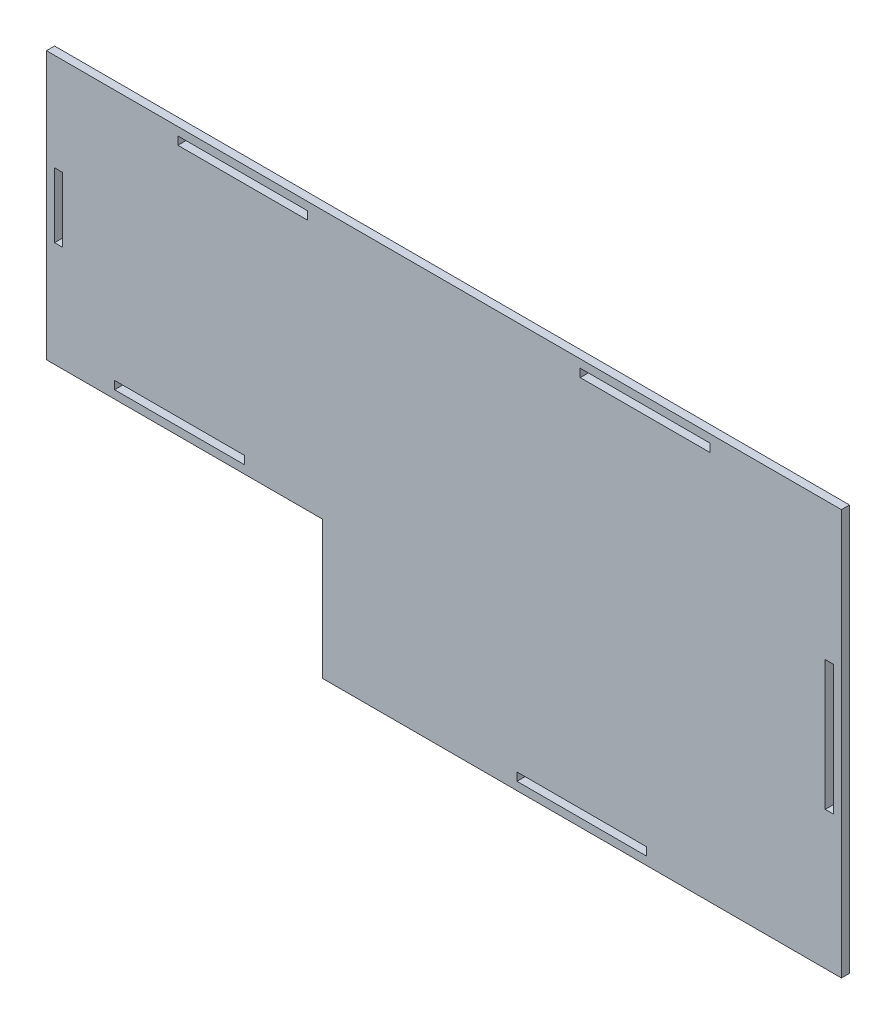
ISO-10303-21;
HEADER;
FILE_DESCRIPTION(('STEP AP214'),'2;1');
FILE_NAME('part.step','',(''),(''),'','','');
FILE_SCHEMA(('AUTOMOTIVE_DESIGN { 1 0 10303 214 1 1 1 1 }'));
ENDSEC;
DATA;
#1=APPLICATION_CONTEXT('core data for automotive mechanical design processes');
#2=APPLICATION_PROTOCOL_DEFINITION('international standard','automotive_design',2000,#1);
#3=PRODUCT_CONTEXT('',#1,'mechanical');
#4=PRODUCT('Part','Part','',(#3));
#5=PRODUCT_RELATED_PRODUCT_CATEGORY('part','',(#4));
#6=PRODUCT_DEFINITION_FORMATION('','',#4);
#7=PRODUCT_DEFINITION_CONTEXT('part definition',#1,'design');
#8=PRODUCT_DEFINITION('design','',#6,#7);
#9=PRODUCT_DEFINITION_SHAPE('','',#8);
#10=(LENGTH_UNIT() NAMED_UNIT(*) SI_UNIT(.MILLI.,.METRE.));
#11=(NAMED_UNIT(*) PLANE_ANGLE_UNIT() SI_UNIT($,.RADIAN.));
#12=(NAMED_UNIT(*) SI_UNIT($,.STERADIAN.) SOLID_ANGLE_UNIT());
#13=UNCERTAINTY_MEASURE_WITH_UNIT(LENGTH_MEASURE(1.E-05),#10,'distance_accuracy_value','');
#14=(GEOMETRIC_REPRESENTATION_CONTEXT(3) GLOBAL_UNCERTAINTY_ASSIGNED_CONTEXT((#13)) GLOBAL_UNIT_ASSIGNED_CONTEXT((#10,
#11,#12)) REPRESENTATION_CONTEXT('',''));
#15=CARTESIAN_POINT('',(0.,0.,0.));
#16=DIRECTION('',(0.,0.,1.));
#17=DIRECTION('',(1.,0.,0.));
#18=AXIS2_PLACEMENT_3D('',#15,#16,#17);
#19=CARTESIAN_POINT('',(-195.284836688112,2.75233401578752,3.175));
#20=DIRECTION('',(0.,0.,-1.));
#21=DIRECTION('',(-1.,0.,0.));
#22=AXIS2_PLACEMENT_3D('',#19,#20,#21);
#23=PLANE('',#22);
#24=DIRECTION('',(0.,-1.,0.));
#25=VECTOR('',#24,1.);
#26=CARTESIAN_POINT('',(-143.849836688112,104.352334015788,3.175));
#27=LINE('',#26,#25);
#28=CARTESIAN_POINT('',(-143.849836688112,104.352334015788,3.175));
#29=VERTEX_POINT('',#28);
#30=CARTESIAN_POINT('',(-143.849836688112,101.177334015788,3.175));
#31=VERTEX_POINT('',#30);
#32=EDGE_CURVE('E265',#29,#31,#27,.T.);
#33=ORIENTED_EDGE('',*,*,#32,.F.);
#34=DIRECTION('',(-1.,0.,0.));
#35=VECTOR('',#34,1.);
#36=CARTESIAN_POINT('',(-143.849836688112,104.352334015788,3.175));
#37=LINE('',#36,#35);
#38=CARTESIAN_POINT('',(-93.049836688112,104.352334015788,3.175));
#39=VERTEX_POINT('',#38);
#40=EDGE_CURVE('E273',#39,#29,#37,.T.);
#41=ORIENTED_EDGE('',*,*,#40,.F.);
#42=DIRECTION('',(0.,1.,0.));
#43=VECTOR('',#42,1.);
#44=CARTESIAN_POINT('',(-93.049836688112,104.352334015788,3.175));
#45=LINE('',#44,#43);
#46=CARTESIAN_POINT('',(-93.049836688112,101.177334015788,3.175));
#47=VERTEX_POINT('',#46);
#48=EDGE_CURVE('E270',#47,#39,#45,.T.);
#49=ORIENTED_EDGE('',*,*,#48,.F.);
#50=DIRECTION('',(1.,0.,0.));
#51=VECTOR('',#50,1.);
#52=CARTESIAN_POINT('',(-143.849836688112,101.177334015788,3.175));
#53=LINE('',#52,#51);
#54=EDGE_CURVE('E267',#31,#47,#53,.T.);
#55=ORIENTED_EDGE('',*,*,#54,.F.);
#56=EDGE_LOOP('',(#33,#41,#49,#55));
#57=FACE_BOUND('',#56,.T.);
#58=DIRECTION('',(0.,-1.,0.));
#59=VECTOR('',#58,1.);
#60=CARTESIAN_POINT('',(-11.1348366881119,-44.8726659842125,3.175));
#61=LINE('',#60,#59);
#62=CARTESIAN_POINT('',(-11.1348366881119,-44.8726659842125,3.175));
#63=VERTEX_POINT('',#62);
#64=CARTESIAN_POINT('',(-11.1348366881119,-48.0476659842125,3.175));
#65=VERTEX_POINT('',#64);
#66=EDGE_CURVE('E327',#63,#65,#61,.T.);
#67=ORIENTED_EDGE('',*,*,#66,.F.);
#68=DIRECTION('',(-1.,0.,0.));
#69=VECTOR('',#68,1.);
#70=CARTESIAN_POINT('',(-11.1348366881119,-44.8726659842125,3.175));
#71=LINE('',#70,#69);
#72=CARTESIAN_POINT('',(39.6651633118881,-44.8726659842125,3.175));
#73=VERTEX_POINT('',#72);
#74=EDGE_CURVE('E335',#73,#63,#71,.T.);
#75=ORIENTED_EDGE('',*,*,#74,.F.);
#76=DIRECTION('',(0.,1.,0.));
#77=VECTOR('',#76,1.);
#78=CARTESIAN_POINT('',(39.6651633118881,-44.8726659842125,3.175));
#79=LINE('',#78,#77);
#80=CARTESIAN_POINT('',(39.6651633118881,-48.0476659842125,3.175));
#81=VERTEX_POINT('',#80);
#82=EDGE_CURVE('E332',#81,#73,#79,.T.);
#83=ORIENTED_EDGE('',*,*,#82,.F.);
#84=DIRECTION('',(1.,0.,0.));
#85=VECTOR('',#84,1.);
#86=CARTESIAN_POINT('',(-11.1348366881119,-48.0476659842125,3.175));
#87=LINE('',#86,#85);
#88=EDGE_CURVE('E329',#65,#81,#87,.T.);
#89=ORIENTED_EDGE('',*,*,#88,.F.);
#90=EDGE_LOOP('',(#67,#75,#83,#89));
#91=FACE_BOUND('',#90,.T.);
#92=DIRECTION('',(0.,-1.,0.));
#93=VECTOR('',#92,1.);
#94=CARTESIAN_POINT('',(-168.614836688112,5.92733401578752,3.175));
#95=LINE('',#94,#93);
#96=CARTESIAN_POINT('',(-168.614836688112,9.10233401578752,3.175));
#97=VERTEX_POINT('',#96);
#98=CARTESIAN_POINT('',(-168.614836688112,5.92733401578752,3.175));
#99=VERTEX_POINT('',#98);
#100=EDGE_CURVE('E389',#97,#99,#95,.T.);
#101=ORIENTED_EDGE('',*,*,#100,.F.);
#102=DIRECTION('',(-1.,0.,0.));
#103=VECTOR('',#102,1.);
#104=CARTESIAN_POINT('',(-168.614836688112,9.10233401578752,3.175));
#105=LINE('',#104,#103);
#106=CARTESIAN_POINT('',(-117.814836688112,9.10233401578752,3.175));
#107=VERTEX_POINT('',#106);
#108=EDGE_CURVE('E397',#107,#97,#105,.T.);
#109=ORIENTED_EDGE('',*,*,#108,.F.);
#110=DIRECTION('',(0.,1.,0.));
#111=VECTOR('',#110,1.);
#112=CARTESIAN_POINT('',(-117.814836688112,5.92733401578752,3.175));
#113=LINE('',#112,#111);
#114=CARTESIAN_POINT('',(-117.814836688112,5.92733401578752,3.175));
#115=VERTEX_POINT('',#114);
#116=EDGE_CURVE('E394',#115,#107,#113,.T.);
#117=ORIENTED_EDGE('',*,*,#116,.F.);
#118=DIRECTION('',(1.,0.,0.));
#119=VECTOR('',#118,1.);
#120=CARTESIAN_POINT('',(-168.614836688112,5.92733401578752,3.175));
#121=LINE('',#120,#119);
#122=EDGE_CURVE('E391',#99,#115,#121,.T.);
#123=ORIENTED_EDGE('',*,*,#122,.F.);
#124=EDGE_LOOP('',(#101,#109,#117,#123));
#125=FACE_BOUND('',#124,.T.);
#126=DIRECTION('',(1.,0.,0.));
#127=VECTOR('',#126,1.);
#128=CARTESIAN_POINT('',(-87.3348366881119,2.75233401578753,3.175));
#129=LINE('',#128,#127);
#130=CARTESIAN_POINT('',(-195.284836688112,2.75233401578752,3.175));
#131=VERTEX_POINT('',#130);
#132=CARTESIAN_POINT('',(-87.3348366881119,2.75233401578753,3.175));
#133=VERTEX_POINT('',#132);
#134=EDGE_CURVE('E420',#131,#133,#129,.T.);
#135=ORIENTED_EDGE('',*,*,#134,.T.);
#136=DIRECTION('',(0.,-1.,0.));
#137=VECTOR('',#136,1.);
#138=CARTESIAN_POINT('',(-87.3348366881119,2.75233401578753,3.175));
#139=LINE('',#138,#137);
#140=CARTESIAN_POINT('',(-87.3348366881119,-51.2226659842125,3.175));
#141=VERTEX_POINT('',#140);
#142=EDGE_CURVE('E423',#133,#141,#139,.T.);
#143=ORIENTED_EDGE('',*,*,#142,.T.);
#144=DIRECTION('',(1.,0.,0.));
#145=VECTOR('',#144,1.);
#146=CARTESIAN_POINT('',(-87.3348366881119,-51.2226659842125,3.175));
#147=LINE('',#146,#145);
#148=CARTESIAN_POINT('',(115.865163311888,-51.2226659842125,3.175));
#149=VERTEX_POINT('',#148);
#150=EDGE_CURVE('E426',#141,#149,#147,.T.);
#151=ORIENTED_EDGE('',*,*,#150,.T.);
#152=DIRECTION('',(0.,1.,0.));
#153=VECTOR('',#152,1.);
#154=CARTESIAN_POINT('',(115.865163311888,107.527334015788,3.175));
#155=LINE('',#154,#153);
#156=CARTESIAN_POINT('',(115.865163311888,107.527334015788,3.175));
#157=VERTEX_POINT('',#156);
#158=EDGE_CURVE('E428',#149,#157,#155,.T.);
#159=ORIENTED_EDGE('',*,*,#158,.T.);
#160=DIRECTION('',(-1.,0.,0.));
#161=VECTOR('',#160,1.);
#162=CARTESIAN_POINT('',(-195.284836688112,107.527334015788,3.175));
#163=LINE('',#162,#161);
#164=CARTESIAN_POINT('',(-195.284836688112,107.527334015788,3.175));
#165=VERTEX_POINT('',#164);
#166=EDGE_CURVE('E430',#157,#165,#163,.T.);
#167=ORIENTED_EDGE('',*,*,#166,.T.);
#168=DIRECTION('',(0.,-1.,0.));
#169=VECTOR('',#168,1.);
#170=CARTESIAN_POINT('',(-195.284836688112,2.75233401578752,3.175));
#171=LINE('',#170,#169);
#172=EDGE_CURVE('E432',#165,#131,#171,.T.);
#173=ORIENTED_EDGE('',*,*,#172,.T.);
#174=EDGE_LOOP('',(#135,#143,#151,#159,#167,#173));
#175=FACE_BOUND('',#174,.T.);
#176=DIRECTION('',(0.,-1.,0.));
#177=VECTOR('',#176,1.);
#178=CARTESIAN_POINT('',(-192.109836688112,69.4273340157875,3.175));
#179=LINE('',#178,#177);
#180=CARTESIAN_POINT('',(-192.109836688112,69.4273340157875,3.175));
#181=VERTEX_POINT('',#180);
#182=CARTESIAN_POINT('',(-192.109836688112,44.0273340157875,3.175));
#183=VERTEX_POINT('',#182);
#184=EDGE_CURVE('E358',#181,#183,#179,.T.);
#185=ORIENTED_EDGE('',*,*,#184,.F.);
#186=DIRECTION('',(-1.,0.,0.));
#187=VECTOR('',#186,1.);
#188=CARTESIAN_POINT('',(-192.109836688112,69.4273340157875,3.175));
#189=LINE('',#188,#187);
#190=CARTESIAN_POINT('',(-188.934836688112,69.4273340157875,3.175));
#191=VERTEX_POINT('',#190);
#192=EDGE_CURVE('E366',#191,#181,#189,.T.);
#193=ORIENTED_EDGE('',*,*,#192,.F.);
#194=DIRECTION('',(0.,1.,0.));
#195=VECTOR('',#194,1.);
#196=CARTESIAN_POINT('',(-188.934836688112,69.4273340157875,3.175));
#197=LINE('',#196,#195);
#198=CARTESIAN_POINT('',(-188.934836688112,44.0273340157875,3.175));
#199=VERTEX_POINT('',#198);
#200=EDGE_CURVE('E363',#199,#191,#197,.T.);
#201=ORIENTED_EDGE('',*,*,#200,.F.);
#202=DIRECTION('',(1.,0.,0.));
#203=VECTOR('',#202,1.);
#204=CARTESIAN_POINT('',(-192.109836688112,44.0273340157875,3.175));
#205=LINE('',#204,#203);
#206=EDGE_CURVE('E360',#183,#199,#205,.T.);
#207=ORIENTED_EDGE('',*,*,#206,.F.);
#208=EDGE_LOOP('',(#185,#193,#201,#207));
#209=FACE_BOUND('',#208,.T.);
#210=DIRECTION('',(0.,1.,0.));
#211=VECTOR('',#210,1.);
#212=CARTESIAN_POINT('',(112.690163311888,53.5523340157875,3.175));
#213=LINE('',#212,#211);
#214=CARTESIAN_POINT('',(112.690163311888,2.75233401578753,3.175));
#215=VERTEX_POINT('',#214);
#216=CARTESIAN_POINT('',(112.690163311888,53.5523340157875,3.175));
#217=VERTEX_POINT('',#216);
#218=EDGE_CURVE('E296',#215,#217,#213,.T.);
#219=ORIENTED_EDGE('',*,*,#218,.F.);
#220=DIRECTION('',(1.,0.,0.));
#221=VECTOR('',#220,1.);
#222=CARTESIAN_POINT('',(112.690163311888,2.75233401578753,3.175));
#223=LINE('',#222,#221);
#224=CARTESIAN_POINT('',(109.515163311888,2.75233401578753,3.175));
#225=VERTEX_POINT('',#224);
#226=EDGE_CURVE('E304',#225,#215,#223,.T.);
#227=ORIENTED_EDGE('',*,*,#226,.F.);
#228=DIRECTION('',(0.,-1.,0.));
#229=VECTOR('',#228,1.);
#230=CARTESIAN_POINT('',(109.515163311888,53.5523340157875,3.175));
#231=LINE('',#230,#229);
#232=CARTESIAN_POINT('',(109.515163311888,53.5523340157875,3.175));
#233=VERTEX_POINT('',#232);
#234=EDGE_CURVE('E301',#233,#225,#231,.T.);
#235=ORIENTED_EDGE('',*,*,#234,.F.);
#236=DIRECTION('',(-1.,0.,0.));
#237=VECTOR('',#236,1.);
#238=CARTESIAN_POINT('',(112.690163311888,53.5523340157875,3.175));
#239=LINE('',#238,#237);
#240=EDGE_CURVE('E298',#217,#233,#239,.T.);
#241=ORIENTED_EDGE('',*,*,#240,.F.);
#242=EDGE_LOOP('',(#219,#227,#235,#241));
#243=FACE_BOUND('',#242,.T.);
#244=DIRECTION('',(0.,-1.,0.));
#245=VECTOR('',#244,1.);
#246=CARTESIAN_POINT('',(13.6301633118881,104.352334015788,3.175));
#247=LINE('',#246,#245);
#248=CARTESIAN_POINT('',(13.6301633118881,104.352334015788,3.175));
#249=VERTEX_POINT('',#248);
#250=CARTESIAN_POINT('',(13.6301633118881,101.177334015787,3.175));
#251=VERTEX_POINT('',#250);
#252=EDGE_CURVE('E229',#249,#251,#247,.T.);
#253=ORIENTED_EDGE('',*,*,#252,.F.);
#254=DIRECTION('',(-1.,0.,0.));
#255=VECTOR('',#254,1.);
#256=CARTESIAN_POINT('',(13.6301633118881,104.352334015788,3.175));
#257=LINE('',#256,#255);
#258=CARTESIAN_POINT('',(64.4301633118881,104.352334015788,3.175));
#259=VERTEX_POINT('',#258);
#260=EDGE_CURVE('E251',#259,#249,#257,.T.);
#261=ORIENTED_EDGE('',*,*,#260,.F.);
#262=DIRECTION('',(0.,1.,0.));
#263=VECTOR('',#262,1.);
#264=CARTESIAN_POINT('',(64.4301633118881,104.352334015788,3.175));
#265=LINE('',#264,#263);
#266=CARTESIAN_POINT('',(64.4301633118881,101.177334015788,3.175));
#267=VERTEX_POINT('',#266);
#268=EDGE_CURVE('E249',#267,#259,#265,.T.);
#269=ORIENTED_EDGE('',*,*,#268,.F.);
#270=DIRECTION('',(1.,0.,0.));
#271=VECTOR('',#270,1.);
#272=CARTESIAN_POINT('',(13.6301633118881,101.177334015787,3.175));
#273=LINE('',#272,#271);
#274=EDGE_CURVE('E237',#251,#267,#273,.T.);
#275=ORIENTED_EDGE('',*,*,#274,.F.);
#276=EDGE_LOOP('',(#253,#261,#269,#275));
#277=FACE_BOUND('',#276,.T.);
#278=ADVANCED_FACE('F32',(#57,#91,#125,#175,#209,#243,#277),#23,.F.);
#279=CARTESIAN_POINT('',(-195.284836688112,2.75233401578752,0.));
#280=DIRECTION('',(0.,0.,-1.));
#281=DIRECTION('',(-1.,0.,0.));
#282=AXIS2_PLACEMENT_3D('',#279,#280,#281);
#283=PLANE('',#282);
#284=DIRECTION('',(-1.,0.,0.));
#285=VECTOR('',#284,1.);
#286=CARTESIAN_POINT('',(-143.849836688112,104.352334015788,0.));
#287=LINE('',#286,#285);
#288=CARTESIAN_POINT('',(-93.049836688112,104.352334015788,0.));
#289=VERTEX_POINT('',#288);
#290=CARTESIAN_POINT('',(-143.849836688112,104.352334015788,0.));
#291=VERTEX_POINT('',#290);
#292=EDGE_CURVE('E268',#289,#291,#287,.T.);
#293=ORIENTED_EDGE('',*,*,#292,.T.);
#294=DIRECTION('',(0.,-1.,0.));
#295=VECTOR('',#294,1.);
#296=CARTESIAN_POINT('',(-143.849836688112,104.352334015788,0.));
#297=LINE('',#296,#295);
#298=CARTESIAN_POINT('',(-143.849836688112,101.177334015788,0.));
#299=VERTEX_POINT('',#298);
#300=EDGE_CURVE('E245',#291,#299,#297,.T.);
#301=ORIENTED_EDGE('',*,*,#300,.T.);
#302=DIRECTION('',(1.,0.,0.));
#303=VECTOR('',#302,1.);
#304=CARTESIAN_POINT('',(-143.849836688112,101.177334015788,0.));
#305=LINE('',#304,#303);
#306=CARTESIAN_POINT('',(-93.049836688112,101.177334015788,0.));
#307=VERTEX_POINT('',#306);
#308=EDGE_CURVE('E278',#299,#307,#305,.T.);
#309=ORIENTED_EDGE('',*,*,#308,.T.);
#310=DIRECTION('',(0.,1.,0.));
#311=VECTOR('',#310,1.);
#312=CARTESIAN_POINT('',(-93.049836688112,104.352334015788,0.));
#313=LINE('',#312,#311);
#314=EDGE_CURVE('E281',#307,#289,#313,.T.);
#315=ORIENTED_EDGE('',*,*,#314,.T.);
#316=EDGE_LOOP('',(#293,#301,#309,#315));
#317=FACE_BOUND('',#316,.T.);
#318=DIRECTION('',(-1.,0.,0.));
#319=VECTOR('',#318,1.);
#320=CARTESIAN_POINT('',(-11.1348366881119,-44.8726659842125,0.));
#321=LINE('',#320,#319);
#322=CARTESIAN_POINT('',(39.6651633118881,-44.8726659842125,0.));
#323=VERTEX_POINT('',#322);
#324=CARTESIAN_POINT('',(-11.1348366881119,-44.8726659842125,0.));
#325=VERTEX_POINT('',#324);
#326=EDGE_CURVE('E330',#323,#325,#321,.T.);
#327=ORIENTED_EDGE('',*,*,#326,.T.);
#328=DIRECTION('',(0.,-1.,0.));
#329=VECTOR('',#328,1.);
#330=CARTESIAN_POINT('',(-11.1348366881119,-44.8726659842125,0.));
#331=LINE('',#330,#329);
#332=CARTESIAN_POINT('',(-11.1348366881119,-48.0476659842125,0.));
#333=VERTEX_POINT('',#332);
#334=EDGE_CURVE('E326',#325,#333,#331,.T.);
#335=ORIENTED_EDGE('',*,*,#334,.T.);
#336=DIRECTION('',(1.,0.,0.));
#337=VECTOR('',#336,1.);
#338=CARTESIAN_POINT('',(-11.1348366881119,-48.0476659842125,0.));
#339=LINE('',#338,#337);
#340=CARTESIAN_POINT('',(39.6651633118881,-48.0476659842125,0.));
#341=VERTEX_POINT('',#340);
#342=EDGE_CURVE('E340',#333,#341,#339,.T.);
#343=ORIENTED_EDGE('',*,*,#342,.T.);
#344=DIRECTION('',(0.,1.,0.));
#345=VECTOR('',#344,1.);
#346=CARTESIAN_POINT('',(39.6651633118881,-44.8726659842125,0.));
#347=LINE('',#346,#345);
#348=EDGE_CURVE('E343',#341,#323,#347,.T.);
#349=ORIENTED_EDGE('',*,*,#348,.T.);
#350=EDGE_LOOP('',(#327,#335,#343,#349));
#351=FACE_BOUND('',#350,.T.);
#352=DIRECTION('',(-1.,0.,0.));
#353=VECTOR('',#352,1.);
#354=CARTESIAN_POINT('',(-168.614836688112,9.10233401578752,0.));
#355=LINE('',#354,#353);
#356=CARTESIAN_POINT('',(-117.814836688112,9.10233401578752,0.));
#357=VERTEX_POINT('',#356);
#358=CARTESIAN_POINT('',(-168.614836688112,9.10233401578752,0.));
#359=VERTEX_POINT('',#358);
#360=EDGE_CURVE('E392',#357,#359,#355,.T.);
#361=ORIENTED_EDGE('',*,*,#360,.T.);
#362=DIRECTION('',(0.,-1.,0.));
#363=VECTOR('',#362,1.);
#364=CARTESIAN_POINT('',(-168.614836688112,5.92733401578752,0.));
#365=LINE('',#364,#363);
#366=CARTESIAN_POINT('',(-168.614836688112,5.92733401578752,0.));
#367=VERTEX_POINT('',#366);
#368=EDGE_CURVE('E388',#359,#367,#365,.T.);
#369=ORIENTED_EDGE('',*,*,#368,.T.);
#370=DIRECTION('',(1.,0.,0.));
#371=VECTOR('',#370,1.);
#372=CARTESIAN_POINT('',(-168.614836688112,5.92733401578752,0.));
#373=LINE('',#372,#371);
#374=CARTESIAN_POINT('',(-117.814836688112,5.92733401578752,0.));
#375=VERTEX_POINT('',#374);
#376=EDGE_CURVE('E402',#367,#375,#373,.T.);
#377=ORIENTED_EDGE('',*,*,#376,.T.);
#378=DIRECTION('',(0.,1.,0.));
#379=VECTOR('',#378,1.);
#380=CARTESIAN_POINT('',(-117.814836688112,5.92733401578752,0.));
#381=LINE('',#380,#379);
#382=EDGE_CURVE('E405',#375,#357,#381,.T.);
#383=ORIENTED_EDGE('',*,*,#382,.T.);
#384=EDGE_LOOP('',(#361,#369,#377,#383));
#385=FACE_BOUND('',#384,.T.);
#386=DIRECTION('',(1.,0.,0.));
#387=VECTOR('',#386,1.);
#388=CARTESIAN_POINT('',(-87.3348366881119,2.75233401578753,0.));
#389=LINE('',#388,#387);
#390=CARTESIAN_POINT('',(-195.284836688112,2.75233401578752,0.));
#391=VERTEX_POINT('',#390);
#392=CARTESIAN_POINT('',(-87.3348366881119,2.75233401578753,0.));
#393=VERTEX_POINT('',#392);
#394=EDGE_CURVE('E419',#391,#393,#389,.T.);
#395=ORIENTED_EDGE('',*,*,#394,.F.);
#396=DIRECTION('',(0.,-1.,0.));
#397=VECTOR('',#396,1.);
#398=CARTESIAN_POINT('',(-195.284836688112,2.75233401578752,0.));
#399=LINE('',#398,#397);
#400=CARTESIAN_POINT('',(-195.284836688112,107.527334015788,0.));
#401=VERTEX_POINT('',#400);
#402=EDGE_CURVE('E424',#401,#391,#399,.T.);
#403=ORIENTED_EDGE('',*,*,#402,.F.);
#404=DIRECTION('',(-1.,0.,0.));
#405=VECTOR('',#404,1.);
#406=CARTESIAN_POINT('',(-195.284836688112,107.527334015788,0.));
#407=LINE('',#406,#405);
#408=CARTESIAN_POINT('',(115.865163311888,107.527334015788,0.));
#409=VERTEX_POINT('',#408);
#410=EDGE_CURVE('E443',#409,#401,#407,.T.);
#411=ORIENTED_EDGE('',*,*,#410,.F.);
#412=DIRECTION('',(0.,1.,0.));
#413=VECTOR('',#412,1.);
#414=CARTESIAN_POINT('',(115.865163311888,107.527334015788,0.));
#415=LINE('',#414,#413);
#416=CARTESIAN_POINT('',(115.865163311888,-51.2226659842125,0.));
#417=VERTEX_POINT('',#416);
#418=EDGE_CURVE('E441',#417,#409,#415,.T.);
#419=ORIENTED_EDGE('',*,*,#418,.F.);
#420=DIRECTION('',(1.,0.,0.));
#421=VECTOR('',#420,1.);
#422=CARTESIAN_POINT('',(-87.3348366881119,-51.2226659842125,0.));
#423=LINE('',#422,#421);
#424=CARTESIAN_POINT('',(-87.3348366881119,-51.2226659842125,0.));
#425=VERTEX_POINT('',#424);
#426=EDGE_CURVE('E439',#425,#417,#423,.T.);
#427=ORIENTED_EDGE('',*,*,#426,.F.);
#428=DIRECTION('',(0.,-1.,0.));
#429=VECTOR('',#428,1.);
#430=CARTESIAN_POINT('',(-87.3348366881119,2.75233401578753,0.));
#431=LINE('',#430,#429);
#432=EDGE_CURVE('E437',#393,#425,#431,.T.);
#433=ORIENTED_EDGE('',*,*,#432,.F.);
#434=EDGE_LOOP('',(#395,#403,#411,#419,#427,#433));
#435=FACE_BOUND('',#434,.T.);
#436=DIRECTION('',(-1.,0.,0.));
#437=VECTOR('',#436,1.);
#438=CARTESIAN_POINT('',(-192.109836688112,69.4273340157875,0.));
#439=LINE('',#438,#437);
#440=CARTESIAN_POINT('',(-188.934836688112,69.4273340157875,0.));
#441=VERTEX_POINT('',#440);
#442=CARTESIAN_POINT('',(-192.109836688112,69.4273340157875,0.));
#443=VERTEX_POINT('',#442);
#444=EDGE_CURVE('E361',#441,#443,#439,.T.);
#445=ORIENTED_EDGE('',*,*,#444,.T.);
#446=DIRECTION('',(0.,-1.,0.));
#447=VECTOR('',#446,1.);
#448=CARTESIAN_POINT('',(-192.109836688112,69.4273340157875,0.));
#449=LINE('',#448,#447);
#450=CARTESIAN_POINT('',(-192.109836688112,44.0273340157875,0.));
#451=VERTEX_POINT('',#450);
#452=EDGE_CURVE('E357',#443,#451,#449,.T.);
#453=ORIENTED_EDGE('',*,*,#452,.T.);
#454=DIRECTION('',(1.,0.,0.));
#455=VECTOR('',#454,1.);
#456=CARTESIAN_POINT('',(-192.109836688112,44.0273340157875,0.));
#457=LINE('',#456,#455);
#458=CARTESIAN_POINT('',(-188.934836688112,44.0273340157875,0.));
#459=VERTEX_POINT('',#458);
#460=EDGE_CURVE('E371',#451,#459,#457,.T.);
#461=ORIENTED_EDGE('',*,*,#460,.T.);
#462=DIRECTION('',(0.,1.,0.));
#463=VECTOR('',#462,1.);
#464=CARTESIAN_POINT('',(-188.934836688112,69.4273340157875,0.));
#465=LINE('',#464,#463);
#466=EDGE_CURVE('E374',#459,#441,#465,.T.);
#467=ORIENTED_EDGE('',*,*,#466,.T.);
#468=EDGE_LOOP('',(#445,#453,#461,#467));
#469=FACE_BOUND('',#468,.T.);
#470=DIRECTION('',(1.,0.,0.));
#471=VECTOR('',#470,1.);
#472=CARTESIAN_POINT('',(112.690163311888,2.75233401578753,0.));
#473=LINE('',#472,#471);
#474=CARTESIAN_POINT('',(109.515163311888,2.75233401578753,0.));
#475=VERTEX_POINT('',#474);
#476=CARTESIAN_POINT('',(112.690163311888,2.75233401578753,0.));
#477=VERTEX_POINT('',#476);
#478=EDGE_CURVE('E299',#475,#477,#473,.T.);
#479=ORIENTED_EDGE('',*,*,#478,.T.);
#480=DIRECTION('',(0.,1.,0.));
#481=VECTOR('',#480,1.);
#482=CARTESIAN_POINT('',(112.690163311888,53.5523340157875,0.));
#483=LINE('',#482,#481);
#484=CARTESIAN_POINT('',(112.690163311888,53.5523340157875,0.));
#485=VERTEX_POINT('',#484);
#486=EDGE_CURVE('E295',#477,#485,#483,.T.);
#487=ORIENTED_EDGE('',*,*,#486,.T.);
#488=DIRECTION('',(-1.,0.,0.));
#489=VECTOR('',#488,1.);
#490=CARTESIAN_POINT('',(112.690163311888,53.5523340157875,0.));
#491=LINE('',#490,#489);
#492=CARTESIAN_POINT('',(109.515163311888,53.5523340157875,0.));
#493=VERTEX_POINT('',#492);
#494=EDGE_CURVE('E309',#485,#493,#491,.T.);
#495=ORIENTED_EDGE('',*,*,#494,.T.);
#496=DIRECTION('',(0.,-1.,0.));
#497=VECTOR('',#496,1.);
#498=CARTESIAN_POINT('',(109.515163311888,53.5523340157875,0.));
#499=LINE('',#498,#497);
#500=EDGE_CURVE('E312',#493,#475,#499,.T.);
#501=ORIENTED_EDGE('',*,*,#500,.T.);
#502=EDGE_LOOP('',(#479,#487,#495,#501));
#503=FACE_BOUND('',#502,.T.);
#504=DIRECTION('',(-1.,0.,0.));
#505=VECTOR('',#504,1.);
#506=CARTESIAN_POINT('',(13.6301633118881,104.352334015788,0.));
#507=LINE('',#506,#505);
#508=CARTESIAN_POINT('',(64.4301633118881,104.352334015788,0.));
#509=VERTEX_POINT('',#508);
#510=CARTESIAN_POINT('',(13.6301633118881,104.352334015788,0.));
#511=VERTEX_POINT('',#510);
#512=EDGE_CURVE('E238',#509,#511,#507,.T.);
#513=ORIENTED_EDGE('',*,*,#512,.T.);
#514=DIRECTION('',(0.,-1.,0.));
#515=VECTOR('',#514,1.);
#516=CARTESIAN_POINT('',(13.6301633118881,104.352334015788,0.));
#517=LINE('',#516,#515);
#518=CARTESIAN_POINT('',(13.6301633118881,101.177334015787,0.));
#519=VERTEX_POINT('',#518);
#520=EDGE_CURVE('E55',#511,#519,#517,.T.);
#521=ORIENTED_EDGE('',*,*,#520,.T.);
#522=DIRECTION('',(1.,0.,0.));
#523=VECTOR('',#522,1.);
#524=CARTESIAN_POINT('',(13.6301633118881,101.177334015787,0.));
#525=LINE('',#524,#523);
#526=CARTESIAN_POINT('',(64.4301633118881,101.177334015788,0.));
#527=VERTEX_POINT('',#526);
#528=EDGE_CURVE('E244',#519,#527,#525,.T.);
#529=ORIENTED_EDGE('',*,*,#528,.T.);
#530=DIRECTION('',(0.,1.,0.));
#531=VECTOR('',#530,1.);
#532=CARTESIAN_POINT('',(64.4301633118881,104.352334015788,0.));
#533=LINE('',#532,#531);
#534=EDGE_CURVE('E257',#527,#509,#533,.T.);
#535=ORIENTED_EDGE('',*,*,#534,.T.);
#536=EDGE_LOOP('',(#513,#521,#529,#535));
#537=FACE_BOUND('',#536,.T.);
#538=ADVANCED_FACE('F467',(#317,#351,#385,#435,#469,#503,#537),#283,.T.);
#539=CARTESIAN_POINT('',(-87.3348366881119,2.75233401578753,3.175));
#540=DIRECTION('',(0.,1.,0.));
#541=DIRECTION('',(-1.,0.,0.));
#542=AXIS2_PLACEMENT_3D('',#539,#540,#541);
#543=PLANE('',#542);
#544=ORIENTED_EDGE('',*,*,#394,.T.);
#545=DIRECTION('',(0.,0.,-1.));
#546=VECTOR('',#545,1.);
#547=CARTESIAN_POINT('',(-87.3348366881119,2.75233401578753,3.175));
#548=LINE('',#547,#546);
#549=EDGE_CURVE('E11',#133,#393,#548,.T.);
#550=ORIENTED_EDGE('',*,*,#549,.F.);
#551=ORIENTED_EDGE('',*,*,#134,.F.);
#552=DIRECTION('',(0.,0.,-1.));
#553=VECTOR('',#552,1.);
#554=CARTESIAN_POINT('',(-195.284836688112,2.75233401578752,3.175));
#555=LINE('',#554,#553);
#556=EDGE_CURVE('E434',#131,#391,#555,.T.);
#557=ORIENTED_EDGE('',*,*,#556,.T.);
#558=EDGE_LOOP('',(#544,#550,#551,#557));
#559=FACE_BOUND('',#558,.T.);
#560=ADVANCED_FACE('F34',(#559),#543,.F.);
#561=CARTESIAN_POINT('',(-87.3348366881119,2.75233401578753,3.175));
#562=DIRECTION('',(1.,0.,0.));
#563=DIRECTION('',(0.,1.,0.));
#564=AXIS2_PLACEMENT_3D('',#561,#562,#563);
#565=PLANE('',#564);
#566=ORIENTED_EDGE('',*,*,#432,.T.);
#567=DIRECTION('',(0.,0.,-1.));
#568=VECTOR('',#567,1.);
#569=CARTESIAN_POINT('',(-87.3348366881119,-51.2226659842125,3.175));
#570=LINE('',#569,#568);
#571=EDGE_CURVE('E40',#141,#425,#570,.T.);
#572=ORIENTED_EDGE('',*,*,#571,.F.);
#573=ORIENTED_EDGE('',*,*,#142,.F.);
#574=ORIENTED_EDGE('',*,*,#549,.T.);
#575=EDGE_LOOP('',(#566,#572,#573,#574));
#576=FACE_BOUND('',#575,.T.);
#577=ADVANCED_FACE('F485',(#576),#565,.F.);
#578=CARTESIAN_POINT('',(-87.3348366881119,-51.2226659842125,3.175));
#579=DIRECTION('',(0.,1.,0.));
#580=DIRECTION('',(0.,0.,1.));
#581=AXIS2_PLACEMENT_3D('',#578,#579,#580);
#582=PLANE('',#581);
#583=ORIENTED_EDGE('',*,*,#426,.T.);
#584=DIRECTION('',(0.,0.,-1.));
#585=VECTOR('',#584,1.);
#586=CARTESIAN_POINT('',(115.865163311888,-51.2226659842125,3.175));
#587=LINE('',#586,#585);
#588=EDGE_CURVE('E454',#149,#417,#587,.T.);
#589=ORIENTED_EDGE('',*,*,#588,.F.);
#590=ORIENTED_EDGE('',*,*,#150,.F.);
#591=ORIENTED_EDGE('',*,*,#571,.T.);
#592=EDGE_LOOP('',(#583,#589,#590,#591));
#593=FACE_BOUND('',#592,.T.);
#594=ADVANCED_FACE('F461',(#593),#582,.F.);
#595=CARTESIAN_POINT('',(115.865163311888,107.527334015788,3.175));
#596=DIRECTION('',(-1.,0.,0.));
#597=DIRECTION('',(0.,-1.,0.));
#598=AXIS2_PLACEMENT_3D('',#595,#596,#597);
#599=PLANE('',#598);
#600=ORIENTED_EDGE('',*,*,#418,.T.);
#601=DIRECTION('',(0.,0.,-1.));
#602=VECTOR('',#601,1.);
#603=CARTESIAN_POINT('',(115.865163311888,107.527334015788,3.175));
#604=LINE('',#603,#602);
#605=EDGE_CURVE('E451',#157,#409,#604,.T.);
#606=ORIENTED_EDGE('',*,*,#605,.F.);
#607=ORIENTED_EDGE('',*,*,#158,.F.);
#608=ORIENTED_EDGE('',*,*,#588,.T.);
#609=EDGE_LOOP('',(#600,#606,#607,#608));
#610=FACE_BOUND('',#609,.T.);
#611=ADVANCED_FACE('F473',(#610),#599,.F.);
#612=CARTESIAN_POINT('',(-195.284836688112,107.527334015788,3.175));
#613=DIRECTION('',(0.,-1.,0.));
#614=DIRECTION('',(0.,0.,-1.));
#615=AXIS2_PLACEMENT_3D('',#612,#613,#614);
#616=PLANE('',#615);
#617=ORIENTED_EDGE('',*,*,#410,.T.);
#618=DIRECTION('',(0.,0.,-1.));
#619=VECTOR('',#618,1.);
#620=CARTESIAN_POINT('',(-195.284836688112,107.527334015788,3.175));
#621=LINE('',#620,#619);
#622=EDGE_CURVE('E448',#165,#401,#621,.T.);
#623=ORIENTED_EDGE('',*,*,#622,.F.);
#624=ORIENTED_EDGE('',*,*,#166,.F.);
#625=ORIENTED_EDGE('',*,*,#605,.T.);
#626=EDGE_LOOP('',(#617,#623,#624,#625));
#627=FACE_BOUND('',#626,.T.);
#628=ADVANCED_FACE('F477',(#627),#616,.F.);
#629=CARTESIAN_POINT('',(-195.284836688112,2.75233401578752,3.175));
#630=DIRECTION('',(1.,0.,0.));
#631=DIRECTION('',(0.,1.,0.));
#632=AXIS2_PLACEMENT_3D('',#629,#630,#631);
#633=PLANE('',#632);
#634=ORIENTED_EDGE('',*,*,#402,.T.);
#635=ORIENTED_EDGE('',*,*,#556,.F.);
#636=ORIENTED_EDGE('',*,*,#172,.F.);
#637=ORIENTED_EDGE('',*,*,#622,.T.);
#638=EDGE_LOOP('',(#634,#635,#636,#637));
#639=FACE_BOUND('',#638,.T.);
#640=ADVANCED_FACE('F488',(#639),#633,.F.);
#641=CARTESIAN_POINT('',(-168.614836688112,5.92733401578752,3.175));
#642=DIRECTION('',(1.,0.,0.));
#643=DIRECTION('',(0.,0.,-1.));
#644=AXIS2_PLACEMENT_3D('',#641,#642,#643);
#645=PLANE('',#644);
#646=ORIENTED_EDGE('',*,*,#368,.F.);
#647=DIRECTION('',(0.,0.,-1.));
#648=VECTOR('',#647,1.);
#649=CARTESIAN_POINT('',(-168.614836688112,9.10233401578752,3.175));
#650=LINE('',#649,#648);
#651=EDGE_CURVE('E399',#97,#359,#650,.T.);
#652=ORIENTED_EDGE('',*,*,#651,.F.);
#653=ORIENTED_EDGE('',*,*,#100,.T.);
#654=DIRECTION('',(0.,0.,-1.));
#655=VECTOR('',#654,1.);
#656=CARTESIAN_POINT('',(-168.614836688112,5.92733401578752,3.175));
#657=LINE('',#656,#655);
#658=EDGE_CURVE('E416',#99,#367,#657,.T.);
#659=ORIENTED_EDGE('',*,*,#658,.T.);
#660=EDGE_LOOP('',(#646,#652,#653,#659));
#661=FACE_BOUND('',#660,.T.);
#662=ADVANCED_FACE('F490',(#661),#645,.T.);
#663=CARTESIAN_POINT('',(-168.614836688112,5.92733401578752,3.175));
#664=DIRECTION('',(0.,1.,0.));
#665=DIRECTION('',(-1.,0.,0.));
#666=AXIS2_PLACEMENT_3D('',#663,#664,#665);
#667=PLANE('',#666);
#668=ORIENTED_EDGE('',*,*,#376,.F.);
#669=ORIENTED_EDGE('',*,*,#658,.F.);
#670=ORIENTED_EDGE('',*,*,#122,.T.);
#671=DIRECTION('',(0.,0.,-1.));
#672=VECTOR('',#671,1.);
#673=CARTESIAN_POINT('',(-117.814836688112,5.92733401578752,3.175));
#674=LINE('',#673,#672);
#675=EDGE_CURVE('E414',#115,#375,#674,.T.);
#676=ORIENTED_EDGE('',*,*,#675,.T.);
#677=EDGE_LOOP('',(#668,#669,#670,#676));
#678=FACE_BOUND('',#677,.T.);
#679=ADVANCED_FACE('F496',(#678),#667,.T.);
#680=CARTESIAN_POINT('',(-117.814836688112,5.92733401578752,3.175));
#681=DIRECTION('',(-1.,0.,0.));
#682=DIRECTION('',(0.,0.,1.));
#683=AXIS2_PLACEMENT_3D('',#680,#681,#682);
#684=PLANE('',#683);
#685=ORIENTED_EDGE('',*,*,#382,.F.);
#686=ORIENTED_EDGE('',*,*,#675,.F.);
#687=ORIENTED_EDGE('',*,*,#116,.T.);
#688=DIRECTION('',(0.,0.,-1.));
#689=VECTOR('',#688,1.);
#690=CARTESIAN_POINT('',(-117.814836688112,9.10233401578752,3.175));
#691=LINE('',#690,#689);
#692=EDGE_CURVE('E412',#107,#357,#691,.T.);
#693=ORIENTED_EDGE('',*,*,#692,.T.);
#694=EDGE_LOOP('',(#685,#686,#687,#693));
#695=FACE_BOUND('',#694,.T.);
#696=ADVANCED_FACE('F513',(#695),#684,.T.);
#697=CARTESIAN_POINT('',(-168.614836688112,9.10233401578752,3.175));
#698=DIRECTION('',(0.,-1.,0.));
#699=DIRECTION('',(0.,0.,-1.));
#700=AXIS2_PLACEMENT_3D('',#697,#698,#699);
#701=PLANE('',#700);
#702=ORIENTED_EDGE('',*,*,#360,.F.);
#703=ORIENTED_EDGE('',*,*,#692,.F.);
#704=ORIENTED_EDGE('',*,*,#108,.T.);
#705=ORIENTED_EDGE('',*,*,#651,.T.);
#706=EDGE_LOOP('',(#702,#703,#704,#705));
#707=FACE_BOUND('',#706,.T.);
#708=ADVANCED_FACE('F517',(#707),#701,.T.);
#709=CARTESIAN_POINT('',(-192.109836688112,69.4273340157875,3.175));
#710=DIRECTION('',(1.,0.,0.));
#711=DIRECTION('',(0.,0.,-1.));
#712=AXIS2_PLACEMENT_3D('',#709,#710,#711);
#713=PLANE('',#712);
#714=ORIENTED_EDGE('',*,*,#452,.F.);
#715=DIRECTION('',(0.,0.,-1.));
#716=VECTOR('',#715,1.);
#717=CARTESIAN_POINT('',(-192.109836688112,69.4273340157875,3.175));
#718=LINE('',#717,#716);
#719=EDGE_CURVE('E368',#181,#443,#718,.T.);
#720=ORIENTED_EDGE('',*,*,#719,.F.);
#721=ORIENTED_EDGE('',*,*,#184,.T.);
#722=DIRECTION('',(0.,0.,-1.));
#723=VECTOR('',#722,1.);
#724=CARTESIAN_POINT('',(-192.109836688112,44.0273340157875,3.175));
#725=LINE('',#724,#723);
#726=EDGE_CURVE('E385',#183,#451,#725,.T.);
#727=ORIENTED_EDGE('',*,*,#726,.T.);
#728=EDGE_LOOP('',(#714,#720,#721,#727));
#729=FACE_BOUND('',#728,.T.);
#730=ADVANCED_FACE('F521',(#729),#713,.T.);
#731=CARTESIAN_POINT('',(-192.109836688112,44.0273340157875,3.175));
#732=DIRECTION('',(0.,1.,0.));
#733=DIRECTION('',(0.,0.,1.));
#734=AXIS2_PLACEMENT_3D('',#731,#732,#733);
#735=PLANE('',#734);
#736=ORIENTED_EDGE('',*,*,#460,.F.);
#737=ORIENTED_EDGE('',*,*,#726,.F.);
#738=ORIENTED_EDGE('',*,*,#206,.T.);
#739=DIRECTION('',(0.,0.,-1.));
#740=VECTOR('',#739,1.);
#741=CARTESIAN_POINT('',(-188.934836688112,44.0273340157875,3.175));
#742=LINE('',#741,#740);
#743=EDGE_CURVE('E383',#199,#459,#742,.T.);
#744=ORIENTED_EDGE('',*,*,#743,.T.);
#745=EDGE_LOOP('',(#736,#737,#738,#744));
#746=FACE_BOUND('',#745,.T.);
#747=ADVANCED_FACE('F525',(#746),#735,.T.);
#748=CARTESIAN_POINT('',(-188.934836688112,69.4273340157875,3.175));
#749=DIRECTION('',(-1.,0.,0.));
#750=DIRECTION('',(0.,0.,1.));
#751=AXIS2_PLACEMENT_3D('',#748,#749,#750);
#752=PLANE('',#751);
#753=ORIENTED_EDGE('',*,*,#466,.F.);
#754=ORIENTED_EDGE('',*,*,#743,.F.);
#755=ORIENTED_EDGE('',*,*,#200,.T.);
#756=DIRECTION('',(0.,0.,-1.));
#757=VECTOR('',#756,1.);
#758=CARTESIAN_POINT('',(-188.934836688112,69.4273340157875,3.175));
#759=LINE('',#758,#757);
#760=EDGE_CURVE('E381',#191,#441,#759,.T.);
#761=ORIENTED_EDGE('',*,*,#760,.T.);
#762=EDGE_LOOP('',(#753,#754,#755,#761));
#763=FACE_BOUND('',#762,.T.);
#764=ADVANCED_FACE('F529',(#763),#752,.T.);
#765=CARTESIAN_POINT('',(-192.109836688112,69.4273340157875,3.175));
#766=DIRECTION('',(0.,-1.,0.));
#767=DIRECTION('',(0.,0.,-1.));
#768=AXIS2_PLACEMENT_3D('',#765,#766,#767);
#769=PLANE('',#768);
#770=ORIENTED_EDGE('',*,*,#444,.F.);
#771=ORIENTED_EDGE('',*,*,#760,.F.);
#772=ORIENTED_EDGE('',*,*,#192,.T.);
#773=ORIENTED_EDGE('',*,*,#719,.T.);
#774=EDGE_LOOP('',(#770,#771,#772,#773));
#775=FACE_BOUND('',#774,.T.);
#776=ADVANCED_FACE('F533',(#775),#769,.T.);
#777=CARTESIAN_POINT('',(-11.1348366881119,-44.8726659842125,3.175));
#778=DIRECTION('',(1.,0.,0.));
#779=DIRECTION('',(0.,1.,0.));
#780=AXIS2_PLACEMENT_3D('',#777,#778,#779);
#781=PLANE('',#780);
#782=ORIENTED_EDGE('',*,*,#334,.F.);
#783=DIRECTION('',(0.,0.,-1.));
#784=VECTOR('',#783,1.);
#785=CARTESIAN_POINT('',(-11.1348366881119,-44.8726659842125,3.175));
#786=LINE('',#785,#784);
#787=EDGE_CURVE('E337',#63,#325,#786,.T.);
#788=ORIENTED_EDGE('',*,*,#787,.F.);
#789=ORIENTED_EDGE('',*,*,#66,.T.);
#790=DIRECTION('',(0.,0.,-1.));
#791=VECTOR('',#790,1.);
#792=CARTESIAN_POINT('',(-11.1348366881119,-48.0476659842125,3.175));
#793=LINE('',#792,#791);
#794=EDGE_CURVE('E354',#65,#333,#793,.T.);
#795=ORIENTED_EDGE('',*,*,#794,.T.);
#796=EDGE_LOOP('',(#782,#788,#789,#795));
#797=FACE_BOUND('',#796,.T.);
#798=ADVANCED_FACE('F537',(#797),#781,.T.);
#799=CARTESIAN_POINT('',(-11.1348366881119,-48.0476659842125,3.175));
#800=DIRECTION('',(0.,1.,0.));
#801=DIRECTION('',(0.,0.,1.));
#802=AXIS2_PLACEMENT_3D('',#799,#800,#801);
#803=PLANE('',#802);
#804=ORIENTED_EDGE('',*,*,#342,.F.);
#805=ORIENTED_EDGE('',*,*,#794,.F.);
#806=ORIENTED_EDGE('',*,*,#88,.T.);
#807=DIRECTION('',(0.,0.,-1.));
#808=VECTOR('',#807,1.);
#809=CARTESIAN_POINT('',(39.6651633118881,-48.0476659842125,3.175));
#810=LINE('',#809,#808);
#811=EDGE_CURVE('E352',#81,#341,#810,.T.);
#812=ORIENTED_EDGE('',*,*,#811,.T.);
#813=EDGE_LOOP('',(#804,#805,#806,#812));
#814=FACE_BOUND('',#813,.T.);
#815=ADVANCED_FACE('F541',(#814),#803,.T.);
#816=CARTESIAN_POINT('',(39.6651633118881,-44.8726659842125,3.175));
#817=DIRECTION('',(-1.,0.,0.));
#818=DIRECTION('',(0.,0.,1.));
#819=AXIS2_PLACEMENT_3D('',#816,#817,#818);
#820=PLANE('',#819);
#821=ORIENTED_EDGE('',*,*,#348,.F.);
#822=ORIENTED_EDGE('',*,*,#811,.F.);
#823=ORIENTED_EDGE('',*,*,#82,.T.);
#824=DIRECTION('',(0.,0.,-1.));
#825=VECTOR('',#824,1.);
#826=CARTESIAN_POINT('',(39.6651633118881,-44.8726659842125,3.175));
#827=LINE('',#826,#825);
#828=EDGE_CURVE('E350',#73,#323,#827,.T.);
#829=ORIENTED_EDGE('',*,*,#828,.T.);
#830=EDGE_LOOP('',(#821,#822,#823,#829));
#831=FACE_BOUND('',#830,.T.);
#832=ADVANCED_FACE('F545',(#831),#820,.T.);
#833=CARTESIAN_POINT('',(-11.1348366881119,-44.8726659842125,3.175));
#834=DIRECTION('',(0.,-1.,0.));
#835=DIRECTION('',(1.,0.,0.));
#836=AXIS2_PLACEMENT_3D('',#833,#834,#835);
#837=PLANE('',#836);
#838=ORIENTED_EDGE('',*,*,#326,.F.);
#839=ORIENTED_EDGE('',*,*,#828,.F.);
#840=ORIENTED_EDGE('',*,*,#74,.T.);
#841=ORIENTED_EDGE('',*,*,#787,.T.);
#842=EDGE_LOOP('',(#838,#839,#840,#841));
#843=FACE_BOUND('',#842,.T.);
#844=ADVANCED_FACE('F549',(#843),#837,.T.);
#845=CARTESIAN_POINT('',(112.690163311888,53.5523340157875,3.175));
#846=DIRECTION('',(-1.,0.,0.));
#847=DIRECTION('',(0.,-1.,0.));
#848=AXIS2_PLACEMENT_3D('',#845,#846,#847);
#849=PLANE('',#848);
#850=ORIENTED_EDGE('',*,*,#486,.F.);
#851=DIRECTION('',(0.,0.,-1.));
#852=VECTOR('',#851,1.);
#853=CARTESIAN_POINT('',(112.690163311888,2.75233401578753,3.175));
#854=LINE('',#853,#852);
#855=EDGE_CURVE('E306',#215,#477,#854,.T.);
#856=ORIENTED_EDGE('',*,*,#855,.F.);
#857=ORIENTED_EDGE('',*,*,#218,.T.);
#858=DIRECTION('',(0.,0.,-1.));
#859=VECTOR('',#858,1.);
#860=CARTESIAN_POINT('',(112.690163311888,53.5523340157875,3.175));
#861=LINE('',#860,#859);
#862=EDGE_CURVE('E323',#217,#485,#861,.T.);
#863=ORIENTED_EDGE('',*,*,#862,.T.);
#864=EDGE_LOOP('',(#850,#856,#857,#863));
#865=FACE_BOUND('',#864,.T.);
#866=ADVANCED_FACE('F553',(#865),#849,.T.);
#867=CARTESIAN_POINT('',(112.690163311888,53.5523340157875,3.175));
#868=DIRECTION('',(0.,-1.,0.));
#869=DIRECTION('',(0.,0.,-1.));
#870=AXIS2_PLACEMENT_3D('',#867,#868,#869);
#871=PLANE('',#870);
#872=ORIENTED_EDGE('',*,*,#494,.F.);
#873=ORIENTED_EDGE('',*,*,#862,.F.);
#874=ORIENTED_EDGE('',*,*,#240,.T.);
#875=DIRECTION('',(0.,0.,-1.));
#876=VECTOR('',#875,1.);
#877=CARTESIAN_POINT('',(109.515163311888,53.5523340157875,3.175));
#878=LINE('',#877,#876);
#879=EDGE_CURVE('E321',#233,#493,#878,.T.);
#880=ORIENTED_EDGE('',*,*,#879,.T.);
#881=EDGE_LOOP('',(#872,#873,#874,#880));
#882=FACE_BOUND('',#881,.T.);
#883=ADVANCED_FACE('F557',(#882),#871,.T.);
#884=CARTESIAN_POINT('',(109.515163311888,53.5523340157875,3.175));
#885=DIRECTION('',(1.,0.,0.));
#886=DIRECTION('',(0.,1.,0.));
#887=AXIS2_PLACEMENT_3D('',#884,#885,#886);
#888=PLANE('',#887);
#889=ORIENTED_EDGE('',*,*,#500,.F.);
#890=ORIENTED_EDGE('',*,*,#879,.F.);
#891=ORIENTED_EDGE('',*,*,#234,.T.);
#892=DIRECTION('',(0.,0.,-1.));
#893=VECTOR('',#892,1.);
#894=CARTESIAN_POINT('',(109.515163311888,2.75233401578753,3.175));
#895=LINE('',#894,#893);
#896=EDGE_CURVE('E319',#225,#475,#895,.T.);
#897=ORIENTED_EDGE('',*,*,#896,.T.);
#898=EDGE_LOOP('',(#889,#890,#891,#897));
#899=FACE_BOUND('',#898,.T.);
#900=ADVANCED_FACE('F561',(#899),#888,.T.);
#901=CARTESIAN_POINT('',(112.690163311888,2.75233401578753,3.175));
#902=DIRECTION('',(0.,1.,0.));
#903=DIRECTION('',(-1.,0.,0.));
#904=AXIS2_PLACEMENT_3D('',#901,#902,#903);
#905=PLANE('',#904);
#906=ORIENTED_EDGE('',*,*,#478,.F.);
#907=ORIENTED_EDGE('',*,*,#896,.F.);
#908=ORIENTED_EDGE('',*,*,#226,.T.);
#909=ORIENTED_EDGE('',*,*,#855,.T.);
#910=EDGE_LOOP('',(#906,#907,#908,#909));
#911=FACE_BOUND('',#910,.T.);
#912=ADVANCED_FACE('F565',(#911),#905,.T.);
#913=CARTESIAN_POINT('',(-143.849836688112,104.352334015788,3.175));
#914=DIRECTION('',(1.,0.,0.));
#915=DIRECTION('',(0.,0.,-1.));
#916=AXIS2_PLACEMENT_3D('',#913,#914,#915);
#917=PLANE('',#916);
#918=ORIENTED_EDGE('',*,*,#300,.F.);
#919=DIRECTION('',(0.,0.,-1.));
#920=VECTOR('',#919,1.);
#921=CARTESIAN_POINT('',(-143.849836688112,104.352334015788,3.175));
#922=LINE('',#921,#920);
#923=EDGE_CURVE('E275',#29,#291,#922,.T.);
#924=ORIENTED_EDGE('',*,*,#923,.F.);
#925=ORIENTED_EDGE('',*,*,#32,.T.);
#926=DIRECTION('',(0.,0.,-1.));
#927=VECTOR('',#926,1.);
#928=CARTESIAN_POINT('',(-143.849836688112,101.177334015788,3.175));
#929=LINE('',#928,#927);
#930=EDGE_CURVE('E292',#31,#299,#929,.T.);
#931=ORIENTED_EDGE('',*,*,#930,.T.);
#932=EDGE_LOOP('',(#918,#924,#925,#931));
#933=FACE_BOUND('',#932,.T.);
#934=ADVANCED_FACE('F569',(#933),#917,.T.);
#935=CARTESIAN_POINT('',(-143.849836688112,101.177334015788,3.175));
#936=DIRECTION('',(0.,1.,0.));
#937=DIRECTION('',(-1.,0.,0.));
#938=AXIS2_PLACEMENT_3D('',#935,#936,#937);
#939=PLANE('',#938);
#940=ORIENTED_EDGE('',*,*,#308,.F.);
#941=ORIENTED_EDGE('',*,*,#930,.F.);
#942=ORIENTED_EDGE('',*,*,#54,.T.);
#943=DIRECTION('',(0.,0.,-1.));
#944=VECTOR('',#943,1.);
#945=CARTESIAN_POINT('',(-93.049836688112,101.177334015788,3.175));
#946=LINE('',#945,#944);
#947=EDGE_CURVE('E290',#47,#307,#946,.T.);
#948=ORIENTED_EDGE('',*,*,#947,.T.);
#949=EDGE_LOOP('',(#940,#941,#942,#948));
#950=FACE_BOUND('',#949,.T.);
#951=ADVANCED_FACE('F573',(#950),#939,.T.);
#952=CARTESIAN_POINT('',(-93.049836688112,104.352334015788,3.175));
#953=DIRECTION('',(-1.,0.,0.));
#954=DIRECTION('',(0.,0.,1.));
#955=AXIS2_PLACEMENT_3D('',#952,#953,#954);
#956=PLANE('',#955);
#957=ORIENTED_EDGE('',*,*,#314,.F.);
#958=ORIENTED_EDGE('',*,*,#947,.F.);
#959=ORIENTED_EDGE('',*,*,#48,.T.);
#960=DIRECTION('',(0.,0.,-1.));
#961=VECTOR('',#960,1.);
#962=CARTESIAN_POINT('',(-93.049836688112,104.352334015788,3.175));
#963=LINE('',#962,#961);
#964=EDGE_CURVE('E288',#39,#289,#963,.T.);
#965=ORIENTED_EDGE('',*,*,#964,.T.);
#966=EDGE_LOOP('',(#957,#958,#959,#965));
#967=FACE_BOUND('',#966,.T.);
#968=ADVANCED_FACE('F577',(#967),#956,.T.);
#969=CARTESIAN_POINT('',(-143.849836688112,104.352334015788,3.175));
#970=DIRECTION('',(0.,-1.,0.));
#971=DIRECTION('',(0.,0.,-1.));
#972=AXIS2_PLACEMENT_3D('',#969,#970,#971);
#973=PLANE('',#972);
#974=ORIENTED_EDGE('',*,*,#292,.F.);
#975=ORIENTED_EDGE('',*,*,#964,.F.);
#976=ORIENTED_EDGE('',*,*,#40,.T.);
#977=ORIENTED_EDGE('',*,*,#923,.T.);
#978=EDGE_LOOP('',(#974,#975,#976,#977));
#979=FACE_BOUND('',#978,.T.);
#980=ADVANCED_FACE('F581',(#979),#973,.T.);
#981=CARTESIAN_POINT('',(13.6301633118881,104.352334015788,3.175));
#982=DIRECTION('',(1.,0.,0.));
#983=DIRECTION('',(0.,0.,-1.));
#984=AXIS2_PLACEMENT_3D('',#981,#982,#983);
#985=PLANE('',#984);
#986=ORIENTED_EDGE('',*,*,#520,.F.);
#987=DIRECTION('',(0.,0.,-1.));
#988=VECTOR('',#987,1.);
#989=CARTESIAN_POINT('',(13.6301633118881,104.352334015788,3.175));
#990=LINE('',#989,#988);
#991=EDGE_CURVE('E233',#249,#511,#990,.T.);
#992=ORIENTED_EDGE('',*,*,#991,.F.);
#993=ORIENTED_EDGE('',*,*,#252,.T.);
#994=DIRECTION('',(0.,0.,-1.));
#995=VECTOR('',#994,1.);
#996=CARTESIAN_POINT('',(13.6301633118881,101.177334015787,3.175));
#997=LINE('',#996,#995);
#998=EDGE_CURVE('E232',#251,#519,#997,.T.);
#999=ORIENTED_EDGE('',*,*,#998,.T.);
#1000=EDGE_LOOP('',(#986,#992,#993,#999));
#1001=FACE_BOUND('',#1000,.T.);
#1002=ADVANCED_FACE('F231',(#1001),#985,.T.);
#1003=CARTESIAN_POINT('',(13.6301633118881,101.177334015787,3.175));
#1004=DIRECTION('',(0.,1.,0.));
#1005=DIRECTION('',(-1.,0.,0.));
#1006=AXIS2_PLACEMENT_3D('',#1003,#1004,#1005);
#1007=PLANE('',#1006);
#1008=ORIENTED_EDGE('',*,*,#528,.F.);
#1009=ORIENTED_EDGE('',*,*,#998,.F.);
#1010=ORIENTED_EDGE('',*,*,#274,.T.);
#1011=DIRECTION('',(0.,0.,-1.));
#1012=VECTOR('',#1011,1.);
#1013=CARTESIAN_POINT('',(64.4301633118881,101.177334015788,3.175));
#1014=LINE('',#1013,#1012);
#1015=EDGE_CURVE('E246',#267,#527,#1014,.T.);
#1016=ORIENTED_EDGE('',*,*,#1015,.T.);
#1017=EDGE_LOOP('',(#1008,#1009,#1010,#1016));
#1018=FACE_BOUND('',#1017,.T.);
#1019=ADVANCED_FACE('F241',(#1018),#1007,.T.);
#1020=CARTESIAN_POINT('',(64.4301633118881,104.352334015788,3.175));
#1021=DIRECTION('',(-1.,0.,0.));
#1022=DIRECTION('',(0.,0.,1.));
#1023=AXIS2_PLACEMENT_3D('',#1020,#1021,#1022);
#1024=PLANE('',#1023);
#1025=ORIENTED_EDGE('',*,*,#534,.F.);
#1026=ORIENTED_EDGE('',*,*,#1015,.F.);
#1027=ORIENTED_EDGE('',*,*,#268,.T.);
#1028=DIRECTION('',(0.,0.,-1.));
#1029=VECTOR('',#1028,1.);
#1030=CARTESIAN_POINT('',(64.4301633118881,104.352334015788,3.175));
#1031=LINE('',#1030,#1029);
#1032=EDGE_CURVE('E47',#259,#509,#1031,.T.);
#1033=ORIENTED_EDGE('',*,*,#1032,.T.);
#1034=EDGE_LOOP('',(#1025,#1026,#1027,#1033));
#1035=FACE_BOUND('',#1034,.T.);
#1036=ADVANCED_FACE('F590',(#1035),#1024,.T.);
#1037=CARTESIAN_POINT('',(13.6301633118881,104.352334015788,3.175));
#1038=DIRECTION('',(0.,-1.,0.));
#1039=DIRECTION('',(1.,0.,0.));
#1040=AXIS2_PLACEMENT_3D('',#1037,#1038,#1039);
#1041=PLANE('',#1040);
#1042=ORIENTED_EDGE('',*,*,#512,.F.);
#1043=ORIENTED_EDGE('',*,*,#1032,.F.);
#1044=ORIENTED_EDGE('',*,*,#260,.T.);
#1045=ORIENTED_EDGE('',*,*,#991,.T.);
#1046=EDGE_LOOP('',(#1042,#1043,#1044,#1045));
#1047=FACE_BOUND('',#1046,.T.);
#1048=ADVANCED_FACE('F593',(#1047),#1041,.T.);
#1049=CLOSED_SHELL('',(#278,#538,#560,#577,#594,#611,#628,#640,#662,#679,#696,#708,#730,#747,
#764,#776,#798,#815,#832,#844,#866,#883,#900,#912,#934,#951,#968,#980,#1002,#1019,#1036,#1048));
#1050=MANIFOLD_SOLID_BREP('B2',#1049);
#1051=ADVANCED_BREP_SHAPE_REPRESENTATION('',(#18,#1050),#14);
#1052=SHAPE_DEFINITION_REPRESENTATION(#9,#1051);
ENDSEC;
END-ISO-10303-21;
